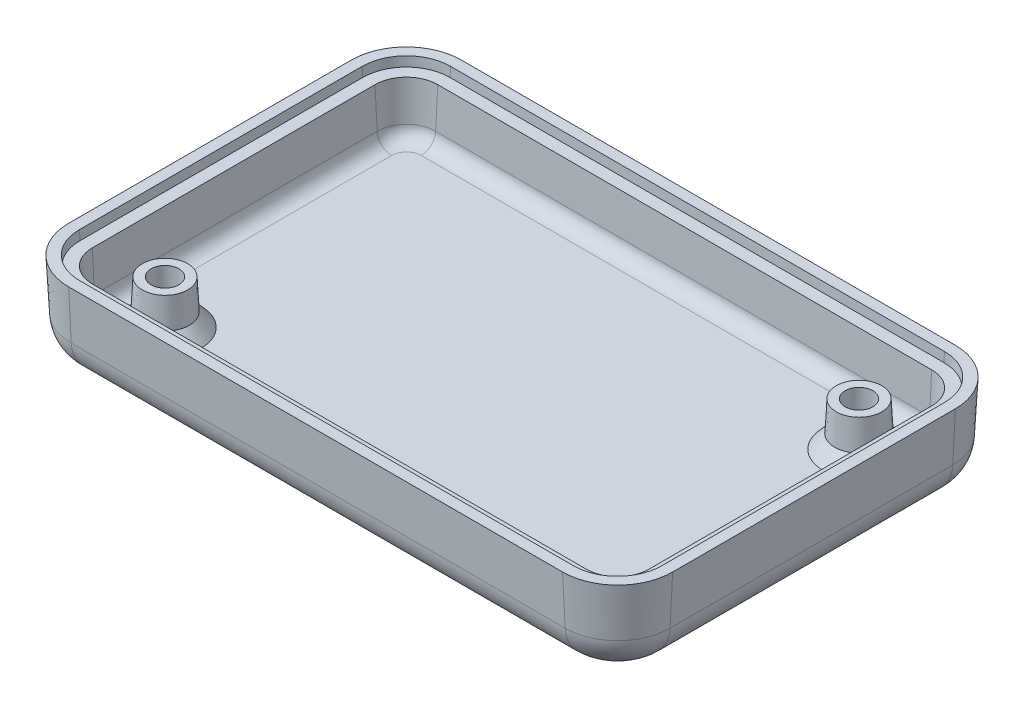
from build123d import *

# Parameters (mm, degrees)
EXTRUDE1_DEPTH     = 9.017
EXTRUDE1_DRAFT     = -3
FILLET1_R          = 3.9624
SHELL1_T           = -2.4384
CUT_EXTRUDE1_DEPTH = 0.9906
CUT_EXTRUDE1_DRAFT = -3
SKETCH6_W          = 32.4104
SKETCH6_H          = 26.0604
CUT_EXTRUDE2_DEPTH = 0.254


with BuildPart() as part:
    # Sketch1 → Extrude1 (with draft: the straight prism first)
    with BuildSketch(Plane(origin=(0, 0, 0), x_dir=(1, 0, 0), z_dir=(0, 1, 0))):
        with BuildLine():
            ThreePointArc((-25.9842, 20.6629), (-30.079196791, 18.966696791), (-31.7754, 14.8717))
            Line((-31.7754, 14.8717), (-31.7754, -14.8717))
            ThreePointArc((-31.7754, -14.8717), (-30.079196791, -18.966696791), (-25.9842, -20.6629))
            Line((-25.9842, -20.6629), (25.9842, -20.6629))
            ThreePointArc((25.9842, -20.6629), (30.079196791, -18.966696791), (31.7754, -14.8717))
            Line((31.7754, -14.8717), (31.7754, 14.8717))
            ThreePointArc((31.7754, 14.8717), (30.079196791, 18.966696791), (25.9842, 20.6629))
            Line((25.9842, 20.6629), (-25.9842, 20.6629))
        make_face()
    extrude(amount=-EXTRUDE1_DEPTH)
    # Extrude1: the draft: its side faces are tilted about the plane it starts from
    extrude1_sides = [part.faces().sort_by_distance(p)[0] for p in [
        (-30.079196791, -4.5085, -18.966696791),
        (-31.7754, -4.5085, 0),
        (-30.079196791, -4.5085, 18.966696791),
        (0, -4.5085, 20.6629),
        (30.079196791, -4.5085, 18.966696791),
        (31.7754, -4.5085, 0),
        (30.079196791, -4.5085, -18.966696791),
        (0, -4.5085, -20.6629),
    ]]
    draft(extrude1_sides, Plane(origin=(0, 0, 0), x_dir=(1, 0, 0), z_dir=(0, 1, 0)), EXTRUDE1_DRAFT)

    # Fillet1
    fillet1_edges = [part.edges().sort_by_distance(p)[0] for p in [
        (29.745045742, -9.017, -18.632545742),
        (0, -9.017, -20.190339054),
        (-29.745045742, -9.017, -18.632545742),
        (-31.302839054, -9.017, 0),
        (-29.745045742, -9.017, 18.632545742),
        (0, -9.017, 20.190339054),
        (29.745045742, -9.017, 18.632545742),
        (31.302839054, -9.017, 0),
    ]]
    fillet(fillet1_edges, radius=FILLET1_R)

    # Shell1
    shell1_openings = [part.faces().sort_by_distance(p)[0] for p in [
        (0, 0, 0),
    ]]
    offset(amount=SHELL1_T, openings=shell1_openings, kind=Kind.INTERSECTION)


with BuildPart() as cut_extrude1_tool:
    # Sketch2 → Cut-Extrude1 (with draft: the straight prism first)
    with BuildSketch(Plane(origin=(0, 0, 0), x_dir=(-1, 0, 0), z_dir=(0, 1, 0))):
        with BuildLine():
            Line((30.6324, -14.8717), (30.6324, 14.8717))
            ThreePointArc((30.6324, 14.8717), (29.27097374, 18.15847374), (25.9842, 19.5199))
            Line((25.9842, 19.5199), (-25.9842, 19.5199))
            ThreePointArc((-25.9842, 19.5199), (-29.27097374, 18.15847374), (-30.6324, 14.8717))
            Line((-30.6324, 14.8717), (-30.6324, -14.8717))
            ThreePointArc((-30.6324, -14.8717), (-29.27097374, -18.15847374), (-25.9842, -19.5199))
            Line((-25.9842, -19.5199), (25.9842, -19.5199))
            ThreePointArc((25.9842, -19.5199), (29.27097374, -18.15847374), (30.6324, -14.8717))
        make_face()
    extrude(amount=-CUT_EXTRUDE1_DEPTH)
    # Cut-Extrude1: the draft: its side faces are tilted about the plane it starts from
    cut_extrude1_sides = [cut_extrude1_tool.faces().sort_by_distance(p)[0] for p in [
        (-30.6324, -0.4953, 0),
        (-29.27097374, -0.4953, 18.15847374),
        (0, -0.4953, 19.5199),
        (29.27097374, -0.4953, 18.15847374),
        (30.6324, -0.4953, 0),
        (29.27097374, -0.4953, -18.15847374),
        (0, -0.4953, -19.5199),
        (-29.27097374, -0.4953, -18.15847374),
    ]]
    draft(cut_extrude1_sides, Plane(origin=(0, 0, 0), x_dir=(-1, 0, 0), z_dir=(0, 1, 0)), CUT_EXTRUDE1_DRAFT)


with BuildPart() as part_1:
    add(part.part)

    # Cut-Extrude1: cut by cut_extrude1_tool
    add(cut_extrude1_tool.part, mode=Mode.SUBTRACT)

    # Sketch4 → Revolve1 (revolve)
    with BuildSketch(Plane.XY.offset(12.7), mode=Mode.PRIVATE) as revolve1_sk:
        Polygon((-23.8125, -1.9812), (-21.4249, -1.9812), (-21.259836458, -5.1308), (-20.001283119, -6.5786), (-23.8125, -6.5786), align=None)
    revolve1 = revolve(revolve1_sk.sketch.rotate(Axis((-23.8125, -6.5786, 12.7), (0, 1, 0)), 90), axis=Axis((-23.8125, -6.5786, 12.7), (0, 1, 0)))

    # Sketch5 → Cut-Revolve1 (revolve, cut)
    with BuildSketch(Plane.XY.offset(12.7), mode=Mode.PRIVATE) as cut_revolve1_sk:
        Polygon((-23.8125, -1.9812), (-22.3480884, -1.9812), (-22.3480884, -6.23956668), (-22.155065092, -6.23956668), (-22.139643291, -6.533832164), (-20.946870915, -7.905959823), (-20.888643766, -9.017), (-23.8125, -9.017), align=None)
    cut_revolve1 = revolve(cut_revolve1_sk.sketch.rotate(Axis((-23.8125, -6.5786, 12.7), (0, 1, 0)), 90), axis=Axis((-23.8125, -6.5786, 12.7), (0, 1, 0)), mode=Mode.SUBTRACT)

    # Mirror1: Revolve1, Cut-Revolve1 across plane
    add(revolve1.mirror(Plane(origin=(0, -6.5786, 0), x_dir=(0.4705882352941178, 0, 0.8823529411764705), z_dir=(0.8823529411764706, 0, -0.4705882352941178))))
    add(cut_revolve1.mirror(Plane(origin=(0, -6.5786, 0), x_dir=(0.4705882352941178, 0, 0.8823529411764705), z_dir=(0.8823529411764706, 0, -0.4705882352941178))), mode=Mode.SUBTRACT)

    # Sketch6 → Cut-Extrude2 (cut)
    with BuildSketch(Plane.XZ.offset(9.017)):
        with Locations((3.2258, 0)):
            Rectangle(SKETCH6_W, SKETCH6_H)
    extrude(amount=-CUT_EXTRUDE2_DEPTH, mode=Mode.SUBTRACT)


solid = part_1.part
